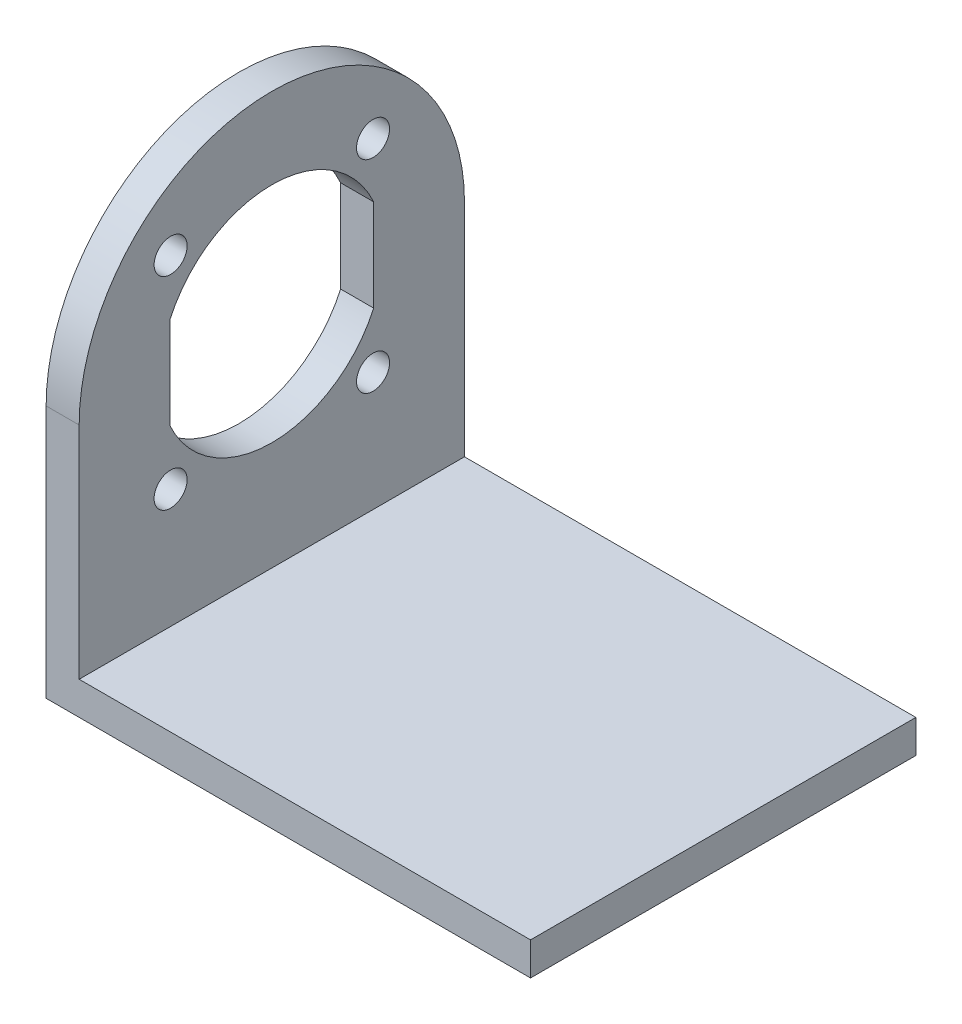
ISO-10303-21;
HEADER;
FILE_DESCRIPTION(('STEP AP214'),'2;1');
FILE_NAME('part.step','',(''),(''),'','','');
FILE_SCHEMA(('AUTOMOTIVE_DESIGN { 1 0 10303 214 1 1 1 1 }'));
ENDSEC;
DATA;
#1=APPLICATION_CONTEXT('core data for automotive mechanical design processes');
#2=APPLICATION_PROTOCOL_DEFINITION('international standard','automotive_design',2000,#1);
#3=PRODUCT_CONTEXT('',#1,'mechanical');
#4=PRODUCT('Part','Part','',(#3));
#5=PRODUCT_RELATED_PRODUCT_CATEGORY('part','',(#4));
#6=PRODUCT_DEFINITION_FORMATION('','',#4);
#7=PRODUCT_DEFINITION_CONTEXT('part definition',#1,'design');
#8=PRODUCT_DEFINITION('design','',#6,#7);
#9=PRODUCT_DEFINITION_SHAPE('','',#8);
#10=(LENGTH_UNIT() NAMED_UNIT(*) SI_UNIT(.MILLI.,.METRE.));
#11=(NAMED_UNIT(*) PLANE_ANGLE_UNIT() SI_UNIT($,.RADIAN.));
#12=(NAMED_UNIT(*) SI_UNIT($,.STERADIAN.) SOLID_ANGLE_UNIT());
#13=UNCERTAINTY_MEASURE_WITH_UNIT(LENGTH_MEASURE(1.E-05),#10,'distance_accuracy_value','');
#14=(GEOMETRIC_REPRESENTATION_CONTEXT(3) GLOBAL_UNCERTAINTY_ASSIGNED_CONTEXT((#13)) GLOBAL_UNIT_ASSIGNED_CONTEXT((#10,
#11,#12)) REPRESENTATION_CONTEXT('',''));
#15=CARTESIAN_POINT('',(0.,0.,0.));
#16=DIRECTION('',(0.,0.,1.));
#17=DIRECTION('',(1.,0.,0.));
#18=AXIS2_PLACEMENT_3D('',#15,#16,#17);
#19=CARTESIAN_POINT('',(3.,40.5,17.5));
#20=DIRECTION('',(-1.,0.,0.));
#21=DIRECTION('',(0.,-1.,0.));
#22=AXIS2_PLACEMENT_3D('',#19,#20,#21);
#23=PLANE('',#22);
#24=CARTESIAN_POINT('',(3.,32.1923881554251,-9.19238815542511));
#25=DIRECTION('',(-1.,0.,0.));
#26=DIRECTION('',(0.,-1.,0.));
#27=AXIS2_PLACEMENT_3D('',#24,#25,#26);
#28=CIRCLE('',#27,1.5);
#29=CARTESIAN_POINT('',(3.,30.6923881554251,-9.19238815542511));
#30=VERTEX_POINT('',#29);
#31=EDGE_CURVE('E275',#30,#30,#28,.F.);
#32=ORIENTED_EDGE('',*,*,#31,.F.);
#33=EDGE_LOOP('',(#32));
#34=FACE_BOUND('',#33,.T.);
#35=CARTESIAN_POINT('',(3.,13.8076118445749,9.19238815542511));
#36=DIRECTION('',(-1.,0.,0.));
#37=DIRECTION('',(0.,-1.,0.));
#38=AXIS2_PLACEMENT_3D('',#35,#36,#37);
#39=CIRCLE('',#38,1.5);
#40=CARTESIAN_POINT('',(3.,12.3076118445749,9.19238815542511));
#41=VERTEX_POINT('',#40);
#42=EDGE_CURVE('E328',#41,#41,#39,.F.);
#43=ORIENTED_EDGE('',*,*,#42,.F.);
#44=EDGE_LOOP('',(#43));
#45=FACE_BOUND('',#44,.T.);
#46=CARTESIAN_POINT('',(3.,23.,0.));
#47=DIRECTION('',(-1.,0.,0.));
#48=DIRECTION('',(0.,-1.,0.));
#49=AXIS2_PLACEMENT_3D('',#46,#47,#48);
#50=CIRCLE('',#49,10.15);
#51=CARTESIAN_POINT('',(3.,27.1785164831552,9.25));
#52=VERTEX_POINT('',#51);
#53=CARTESIAN_POINT('',(3.,27.1785164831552,-9.25));
#54=VERTEX_POINT('',#53);
#55=EDGE_CURVE('E322',#52,#54,#50,.T.);
#56=ORIENTED_EDGE('',*,*,#55,.T.);
#57=DIRECTION('',(0.,-1.,0.));
#58=VECTOR('',#57,1.);
#59=CARTESIAN_POINT('',(3.,40.5,-9.25));
#60=LINE('',#59,#58);
#61=CARTESIAN_POINT('',(3.,18.8214835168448,-9.25));
#62=VERTEX_POINT('',#61);
#63=EDGE_CURVE('E325',#54,#62,#60,.T.);
#64=ORIENTED_EDGE('',*,*,#63,.T.);
#65=CARTESIAN_POINT('',(3.,23.,0.));
#66=DIRECTION('',(-1.,0.,0.));
#67=DIRECTION('',(0.,-1.,0.));
#68=AXIS2_PLACEMENT_3D('',#65,#66,#67);
#69=CIRCLE('',#68,10.15);
#70=CARTESIAN_POINT('',(3.,18.8214835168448,9.25));
#71=VERTEX_POINT('',#70);
#72=EDGE_CURVE('E309',#62,#71,#69,.T.);
#73=ORIENTED_EDGE('',*,*,#72,.T.);
#74=DIRECTION('',(0.,-1.,0.));
#75=VECTOR('',#74,1.);
#76=CARTESIAN_POINT('',(3.,40.5,9.24999999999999));
#77=LINE('',#76,#75);
#78=EDGE_CURVE('E313',#52,#71,#77,.T.);
#79=ORIENTED_EDGE('',*,*,#78,.F.);
#80=EDGE_LOOP('',(#56,#64,#73,#79));
#81=FACE_BOUND('',#80,.T.);
#82=CARTESIAN_POINT('',(3.,13.8076118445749,-9.19238815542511));
#83=DIRECTION('',(-1.,0.,0.));
#84=DIRECTION('',(0.,-1.,0.));
#85=AXIS2_PLACEMENT_3D('',#82,#83,#84);
#86=CIRCLE('',#85,1.5);
#87=CARTESIAN_POINT('',(3.,12.3076118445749,-9.19238815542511));
#88=VERTEX_POINT('',#87);
#89=EDGE_CURVE('E331',#88,#88,#86,.T.);
#90=ORIENTED_EDGE('',*,*,#89,.T.);
#91=EDGE_LOOP('',(#90));
#92=FACE_BOUND('',#91,.T.);
#93=CARTESIAN_POINT('',(3.,32.1923881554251,9.19238815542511));
#94=DIRECTION('',(-1.,0.,0.));
#95=DIRECTION('',(0.,-1.,0.));
#96=AXIS2_PLACEMENT_3D('',#93,#94,#95);
#97=CIRCLE('',#96,1.5);
#98=CARTESIAN_POINT('',(3.,30.6923881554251,9.19238815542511));
#99=VERTEX_POINT('',#98);
#100=EDGE_CURVE('E334',#99,#99,#97,.T.);
#101=ORIENTED_EDGE('',*,*,#100,.T.);
#102=EDGE_LOOP('',(#101));
#103=FACE_BOUND('',#102,.T.);
#104=CARTESIAN_POINT('',(3.,23.,0.));
#105=DIRECTION('',(-1.,0.,0.));
#106=DIRECTION('',(0.,-1.,0.));
#107=AXIS2_PLACEMENT_3D('',#104,#105,#106);
#108=CIRCLE('',#107,17.5);
#109=CARTESIAN_POINT('',(3.,23.,17.5));
#110=VERTEX_POINT('',#109);
#111=CARTESIAN_POINT('',(3.,23.,-17.5));
#112=VERTEX_POINT('',#111);
#113=EDGE_CURVE('E308',#110,#112,#108,.T.);
#114=ORIENTED_EDGE('',*,*,#113,.F.);
#115=DIRECTION('',(0.,1.,0.));
#116=VECTOR('',#115,1.);
#117=CARTESIAN_POINT('',(3.,40.5,17.5));
#118=LINE('',#117,#116);
#119=CARTESIAN_POINT('',(3.,3.,17.5));
#120=VERTEX_POINT('',#119);
#121=EDGE_CURVE('E259',#120,#110,#118,.T.);
#122=ORIENTED_EDGE('',*,*,#121,.F.);
#123=DIRECTION('',(0.,0.,-1.));
#124=VECTOR('',#123,1.);
#125=CARTESIAN_POINT('',(3.,3.,17.5));
#126=LINE('',#125,#124);
#127=CARTESIAN_POINT('',(3.,3.,-17.5));
#128=VERTEX_POINT('',#127);
#129=EDGE_CURVE('E265',#120,#128,#126,.T.);
#130=ORIENTED_EDGE('',*,*,#129,.T.);
#131=DIRECTION('',(0.,1.,0.));
#132=VECTOR('',#131,1.);
#133=CARTESIAN_POINT('',(3.,40.5,-17.5));
#134=LINE('',#133,#132);
#135=EDGE_CURVE('E279',#128,#112,#134,.T.);
#136=ORIENTED_EDGE('',*,*,#135,.T.);
#137=EDGE_LOOP('',(#114,#122,#130,#136));
#138=FACE_BOUND('',#137,.T.);
#139=ADVANCED_FACE('F166',(#34,#45,#81,#92,#103,#138),#23,.F.);
#140=CARTESIAN_POINT('',(0.,0.,17.5));
#141=DIRECTION('',(1.,0.,0.));
#142=DIRECTION('',(0.,0.,-1.));
#143=AXIS2_PLACEMENT_3D('',#140,#141,#142);
#144=PLANE('',#143);
#145=CARTESIAN_POINT('',(0.,32.1923881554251,-9.19238815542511));
#146=DIRECTION('',(-1.,0.,0.));
#147=DIRECTION('',(0.,0.,1.));
#148=AXIS2_PLACEMENT_3D('',#145,#146,#147);
#149=CIRCLE('',#148,1.5);
#150=CARTESIAN_POINT('',(0.,32.1923881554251,-7.69238815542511));
#151=VERTEX_POINT('',#150);
#152=EDGE_CURVE('E564',#151,#151,#149,.F.);
#153=ORIENTED_EDGE('',*,*,#152,.T.);
#154=EDGE_LOOP('',(#153));
#155=FACE_BOUND('',#154,.T.);
#156=CARTESIAN_POINT('',(0.,13.8076118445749,9.19238815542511));
#157=DIRECTION('',(-1.,0.,0.));
#158=DIRECTION('',(0.,0.,1.));
#159=AXIS2_PLACEMENT_3D('',#156,#157,#158);
#160=CIRCLE('',#159,1.5);
#161=CARTESIAN_POINT('',(0.,13.8076118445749,10.6923881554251));
#162=VERTEX_POINT('',#161);
#163=EDGE_CURVE('E251',#162,#162,#160,.F.);
#164=ORIENTED_EDGE('',*,*,#163,.T.);
#165=EDGE_LOOP('',(#164));
#166=FACE_BOUND('',#165,.T.);
#167=CARTESIAN_POINT('',(0.,23.,0.));
#168=DIRECTION('',(-1.,0.,0.));
#169=DIRECTION('',(0.,0.,1.));
#170=AXIS2_PLACEMENT_3D('',#167,#168,#169);
#171=CIRCLE('',#170,10.15);
#172=CARTESIAN_POINT('',(0.,18.8214835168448,-9.25));
#173=VERTEX_POINT('',#172);
#174=CARTESIAN_POINT('',(0.,18.8214835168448,9.25));
#175=VERTEX_POINT('',#174);
#176=EDGE_CURVE('E571',#173,#175,#171,.T.);
#177=ORIENTED_EDGE('',*,*,#176,.F.);
#178=DIRECTION('',(0.,-1.,0.));
#179=VECTOR('',#178,1.);
#180=CARTESIAN_POINT('',(0.,0.,-9.25));
#181=LINE('',#180,#179);
#182=CARTESIAN_POINT('',(0.,27.1785164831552,-9.25));
#183=VERTEX_POINT('',#182);
#184=EDGE_CURVE('E189',#183,#173,#181,.T.);
#185=ORIENTED_EDGE('',*,*,#184,.F.);
#186=CARTESIAN_POINT('',(0.,23.,0.));
#187=DIRECTION('',(-1.,0.,0.));
#188=DIRECTION('',(0.,0.,1.));
#189=AXIS2_PLACEMENT_3D('',#186,#187,#188);
#190=CIRCLE('',#189,10.15);
#191=CARTESIAN_POINT('',(0.,27.1785164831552,9.25));
#192=VERTEX_POINT('',#191);
#193=EDGE_CURVE('E587',#192,#183,#190,.T.);
#194=ORIENTED_EDGE('',*,*,#193,.F.);
#195=DIRECTION('',(0.,-1.,0.));
#196=VECTOR('',#195,1.);
#197=CARTESIAN_POINT('',(0.,0.,9.25));
#198=LINE('',#197,#196);
#199=EDGE_CURVE('E585',#192,#175,#198,.T.);
#200=ORIENTED_EDGE('',*,*,#199,.T.);
#201=EDGE_LOOP('',(#177,#185,#194,#200));
#202=FACE_BOUND('',#201,.T.);
#203=CARTESIAN_POINT('',(0.,13.8076118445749,-9.19238815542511));
#204=DIRECTION('',(-1.,0.,0.));
#205=DIRECTION('',(0.,0.,1.));
#206=AXIS2_PLACEMENT_3D('',#203,#204,#205);
#207=CIRCLE('',#206,1.5);
#208=CARTESIAN_POINT('',(0.,13.8076118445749,-7.69238815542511));
#209=VERTEX_POINT('',#208);
#210=EDGE_CURVE('E575',#209,#209,#207,.T.);
#211=ORIENTED_EDGE('',*,*,#210,.F.);
#212=EDGE_LOOP('',(#211));
#213=FACE_BOUND('',#212,.T.);
#214=CARTESIAN_POINT('',(0.,32.1923881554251,9.19238815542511));
#215=DIRECTION('',(-1.,0.,0.));
#216=DIRECTION('',(0.,0.,1.));
#217=AXIS2_PLACEMENT_3D('',#214,#215,#216);
#218=CIRCLE('',#217,1.5);
#219=CARTESIAN_POINT('',(0.,32.1923881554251,10.6923881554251));
#220=VERTEX_POINT('',#219);
#221=EDGE_CURVE('E577',#220,#220,#218,.T.);
#222=ORIENTED_EDGE('',*,*,#221,.F.);
#223=EDGE_LOOP('',(#222));
#224=FACE_BOUND('',#223,.T.);
#225=DIRECTION('',(0.,-1.,0.));
#226=VECTOR('',#225,1.);
#227=CARTESIAN_POINT('',(0.,0.,17.5));
#228=LINE('',#227,#226);
#229=CARTESIAN_POINT('',(0.,23.,17.5));
#230=VERTEX_POINT('',#229);
#231=CARTESIAN_POINT('',(0.,0.,17.5));
#232=VERTEX_POINT('',#231);
#233=EDGE_CURVE('E256',#230,#232,#228,.T.);
#234=ORIENTED_EDGE('',*,*,#233,.F.);
#235=CARTESIAN_POINT('',(0.,23.,0.));
#236=DIRECTION('',(-1.,0.,0.));
#237=DIRECTION('',(0.,0.,1.));
#238=AXIS2_PLACEMENT_3D('',#235,#236,#237);
#239=CIRCLE('',#238,17.5);
#240=CARTESIAN_POINT('',(0.,23.,-17.5));
#241=VERTEX_POINT('',#240);
#242=EDGE_CURVE('E244',#230,#241,#239,.T.);
#243=ORIENTED_EDGE('',*,*,#242,.T.);
#244=DIRECTION('',(0.,-1.,0.));
#245=VECTOR('',#244,1.);
#246=CARTESIAN_POINT('',(0.,0.,-17.5));
#247=LINE('',#246,#245);
#248=CARTESIAN_POINT('',(0.,0.,-17.5));
#249=VERTEX_POINT('',#248);
#250=EDGE_CURVE('E282',#241,#249,#247,.T.);
#251=ORIENTED_EDGE('',*,*,#250,.T.);
#252=DIRECTION('',(0.,0.,-1.));
#253=VECTOR('',#252,1.);
#254=CARTESIAN_POINT('',(0.,0.,17.5));
#255=LINE('',#254,#253);
#256=EDGE_CURVE('E262',#232,#249,#255,.T.);
#257=ORIENTED_EDGE('',*,*,#256,.F.);
#258=EDGE_LOOP('',(#234,#243,#251,#257));
#259=FACE_BOUND('',#258,.T.);
#260=ADVANCED_FACE('F260',(#155,#166,#202,#213,#224,#259),#144,.F.);
#261=CARTESIAN_POINT('',(44.,0.,17.5));
#262=DIRECTION('',(0.,1.,0.));
#263=DIRECTION('',(-1.,0.,0.));
#264=AXIS2_PLACEMENT_3D('',#261,#262,#263);
#265=PLANE('',#264);
#266=DIRECTION('',(1.,0.,0.));
#267=VECTOR('',#266,1.);
#268=CARTESIAN_POINT('',(44.,0.,-17.5));
#269=LINE('',#268,#267);
#270=CARTESIAN_POINT('',(44.,0.,-17.5));
#271=VERTEX_POINT('',#270);
#272=EDGE_CURVE('E271',#249,#271,#269,.T.);
#273=ORIENTED_EDGE('',*,*,#272,.T.);
#274=DIRECTION('',(0.,0.,-1.));
#275=VECTOR('',#274,1.);
#276=CARTESIAN_POINT('',(44.,0.,17.5));
#277=LINE('',#276,#275);
#278=CARTESIAN_POINT('',(44.,0.,17.5));
#279=VERTEX_POINT('',#278);
#280=EDGE_CURVE('E290',#279,#271,#277,.T.);
#281=ORIENTED_EDGE('',*,*,#280,.F.);
#282=DIRECTION('',(1.,0.,0.));
#283=VECTOR('',#282,1.);
#284=CARTESIAN_POINT('',(44.,0.,17.5));
#285=LINE('',#284,#283);
#286=EDGE_CURVE('E283',#232,#279,#285,.T.);
#287=ORIENTED_EDGE('',*,*,#286,.F.);
#288=ORIENTED_EDGE('',*,*,#256,.T.);
#289=EDGE_LOOP('',(#273,#281,#287,#288));
#290=FACE_BOUND('',#289,.T.);
#291=ADVANCED_FACE('F168',(#290),#265,.F.);
#292=CARTESIAN_POINT('',(44.,3.,17.5));
#293=DIRECTION('',(-1.,0.,0.));
#294=DIRECTION('',(0.,0.,1.));
#295=AXIS2_PLACEMENT_3D('',#292,#293,#294);
#296=PLANE('',#295);
#297=DIRECTION('',(0.,1.,0.));
#298=VECTOR('',#297,1.);
#299=CARTESIAN_POINT('',(44.,3.,-17.5));
#300=LINE('',#299,#298);
#301=CARTESIAN_POINT('',(44.,3.,-17.5));
#302=VERTEX_POINT('',#301);
#303=EDGE_CURVE('E274',#271,#302,#300,.T.);
#304=ORIENTED_EDGE('',*,*,#303,.T.);
#305=DIRECTION('',(0.,0.,-1.));
#306=VECTOR('',#305,1.);
#307=CARTESIAN_POINT('',(44.,3.,17.5));
#308=LINE('',#307,#306);
#309=CARTESIAN_POINT('',(44.,3.,17.5));
#310=VERTEX_POINT('',#309);
#311=EDGE_CURVE('E287',#310,#302,#308,.T.);
#312=ORIENTED_EDGE('',*,*,#311,.F.);
#313=DIRECTION('',(0.,1.,0.));
#314=VECTOR('',#313,1.);
#315=CARTESIAN_POINT('',(44.,3.,17.5));
#316=LINE('',#315,#314);
#317=EDGE_CURVE('E296',#279,#310,#316,.T.);
#318=ORIENTED_EDGE('',*,*,#317,.F.);
#319=ORIENTED_EDGE('',*,*,#280,.T.);
#320=EDGE_LOOP('',(#304,#312,#318,#319));
#321=FACE_BOUND('',#320,.T.);
#322=ADVANCED_FACE('F294',(#321),#296,.F.);
#323=CARTESIAN_POINT('',(3.,3.,17.5));
#324=DIRECTION('',(0.,-1.,0.));
#325=DIRECTION('',(1.,0.,0.));
#326=AXIS2_PLACEMENT_3D('',#323,#324,#325);
#327=PLANE('',#326);
#328=DIRECTION('',(-1.,0.,0.));
#329=VECTOR('',#328,1.);
#330=CARTESIAN_POINT('',(3.,3.,-17.5));
#331=LINE('',#330,#329);
#332=EDGE_CURVE('E277',#302,#128,#331,.T.);
#333=ORIENTED_EDGE('',*,*,#332,.T.);
#334=ORIENTED_EDGE('',*,*,#129,.F.);
#335=DIRECTION('',(-1.,0.,0.));
#336=VECTOR('',#335,1.);
#337=CARTESIAN_POINT('',(3.,3.,17.5));
#338=LINE('',#337,#336);
#339=EDGE_CURVE('E267',#310,#120,#338,.T.);
#340=ORIENTED_EDGE('',*,*,#339,.F.);
#341=ORIENTED_EDGE('',*,*,#311,.T.);
#342=EDGE_LOOP('',(#333,#334,#340,#341));
#343=FACE_BOUND('',#342,.T.);
#344=ADVANCED_FACE('F305',(#343),#327,.F.);
#345=CARTESIAN_POINT('',(0.,0.,17.5));
#346=DIRECTION('',(0.,0.,-1.));
#347=DIRECTION('',(-1.,0.,0.));
#348=AXIS2_PLACEMENT_3D('',#345,#346,#347);
#349=PLANE('',#348);
#350=ORIENTED_EDGE('',*,*,#121,.T.);
#351=DIRECTION('',(-1.,0.,0.));
#352=VECTOR('',#351,1.);
#353=CARTESIAN_POINT('',(35.,23.,17.5));
#354=LINE('',#353,#352);
#355=EDGE_CURVE('E12',#110,#230,#354,.T.);
#356=ORIENTED_EDGE('',*,*,#355,.T.);
#357=ORIENTED_EDGE('',*,*,#233,.T.);
#358=ORIENTED_EDGE('',*,*,#286,.T.);
#359=ORIENTED_EDGE('',*,*,#317,.T.);
#360=ORIENTED_EDGE('',*,*,#339,.T.);
#361=EDGE_LOOP('',(#350,#356,#357,#358,#359,#360));
#362=FACE_BOUND('',#361,.T.);
#363=ADVANCED_FACE('F254',(#362),#349,.F.);
#364=CARTESIAN_POINT('',(0.,0.,-17.5));
#365=DIRECTION('',(0.,0.,-1.));
#366=DIRECTION('',(-1.,0.,0.));
#367=AXIS2_PLACEMENT_3D('',#364,#365,#366);
#368=PLANE('',#367);
#369=DIRECTION('',(-1.,0.,0.));
#370=VECTOR('',#369,1.);
#371=CARTESIAN_POINT('',(35.,23.,-17.5));
#372=LINE('',#371,#370);
#373=EDGE_CURVE('E174',#112,#241,#372,.T.);
#374=ORIENTED_EDGE('',*,*,#373,.F.);
#375=ORIENTED_EDGE('',*,*,#135,.F.);
#376=ORIENTED_EDGE('',*,*,#332,.F.);
#377=ORIENTED_EDGE('',*,*,#303,.F.);
#378=ORIENTED_EDGE('',*,*,#272,.F.);
#379=ORIENTED_EDGE('',*,*,#250,.F.);
#380=EDGE_LOOP('',(#374,#375,#376,#377,#378,#379));
#381=FACE_BOUND('',#380,.T.);
#382=ADVANCED_FACE('F300',(#381),#368,.T.);
#383=CARTESIAN_POINT('',(35.,23.,0.));
#384=DIRECTION('',(-1.,0.,0.));
#385=DIRECTION('',(0.,0.,1.));
#386=AXIS2_PLACEMENT_3D('',#383,#384,#385);
#387=CYLINDRICAL_SURFACE('',#386,17.5);
#388=ORIENTED_EDGE('',*,*,#113,.T.);
#389=ORIENTED_EDGE('',*,*,#373,.T.);
#390=ORIENTED_EDGE('',*,*,#242,.F.);
#391=ORIENTED_EDGE('',*,*,#355,.F.);
#392=EDGE_LOOP('',(#388,#389,#390,#391));
#393=FACE_BOUND('',#392,.T.);
#394=ADVANCED_FACE('F245',(#393),#387,.T.);
#395=CARTESIAN_POINT('',(35.,0.,-9.25));
#396=DIRECTION('',(0.,0.,-1.));
#397=DIRECTION('',(0.,1.,0.));
#398=AXIS2_PLACEMENT_3D('',#395,#396,#397);
#399=PLANE('',#398);
#400=DIRECTION('',(-1.,0.,0.));
#401=VECTOR('',#400,1.);
#402=CARTESIAN_POINT('',(35.,27.1785164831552,-9.25));
#403=LINE('',#402,#401);
#404=EDGE_CURVE('E310',#54,#183,#403,.T.);
#405=ORIENTED_EDGE('',*,*,#404,.T.);
#406=ORIENTED_EDGE('',*,*,#184,.T.);
#407=DIRECTION('',(-1.,0.,0.));
#408=VECTOR('',#407,1.);
#409=CARTESIAN_POINT('',(35.,18.8214835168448,-9.25));
#410=LINE('',#409,#408);
#411=EDGE_CURVE('E318',#62,#173,#410,.T.);
#412=ORIENTED_EDGE('',*,*,#411,.F.);
#413=ORIENTED_EDGE('',*,*,#63,.F.);
#414=EDGE_LOOP('',(#405,#406,#412,#413));
#415=FACE_BOUND('',#414,.T.);
#416=ADVANCED_FACE('F380',(#415),#399,.F.);
#417=CARTESIAN_POINT('',(35.,23.,0.));
#418=DIRECTION('',(-1.,0.,0.));
#419=DIRECTION('',(0.,0.,1.));
#420=AXIS2_PLACEMENT_3D('',#417,#418,#419);
#421=CYLINDRICAL_SURFACE('',#420,10.15);
#422=DIRECTION('',(-1.,0.,0.));
#423=VECTOR('',#422,1.);
#424=CARTESIAN_POINT('',(35.,27.1785164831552,9.25));
#425=LINE('',#424,#423);
#426=EDGE_CURVE('E315',#52,#192,#425,.T.);
#427=ORIENTED_EDGE('',*,*,#426,.T.);
#428=ORIENTED_EDGE('',*,*,#193,.T.);
#429=ORIENTED_EDGE('',*,*,#404,.F.);
#430=ORIENTED_EDGE('',*,*,#55,.F.);
#431=EDGE_LOOP('',(#427,#428,#429,#430));
#432=FACE_BOUND('',#431,.T.);
#433=ADVANCED_FACE('F376',(#432),#421,.F.);
#434=CARTESIAN_POINT('',(35.,0.,9.25));
#435=DIRECTION('',(0.,0.,-1.));
#436=DIRECTION('',(0.,1.,0.));
#437=AXIS2_PLACEMENT_3D('',#434,#435,#436);
#438=PLANE('',#437);
#439=ORIENTED_EDGE('',*,*,#78,.T.);
#440=DIRECTION('',(-1.,0.,0.));
#441=VECTOR('',#440,1.);
#442=CARTESIAN_POINT('',(35.,18.8214835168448,9.25));
#443=LINE('',#442,#441);
#444=EDGE_CURVE('E181',#71,#175,#443,.T.);
#445=ORIENTED_EDGE('',*,*,#444,.T.);
#446=ORIENTED_EDGE('',*,*,#199,.F.);
#447=ORIENTED_EDGE('',*,*,#426,.F.);
#448=EDGE_LOOP('',(#439,#445,#446,#447));
#449=FACE_BOUND('',#448,.T.);
#450=ADVANCED_FACE('F379',(#449),#438,.T.);
#451=CARTESIAN_POINT('',(35.,23.,0.));
#452=DIRECTION('',(-1.,0.,0.));
#453=DIRECTION('',(0.,0.,1.));
#454=AXIS2_PLACEMENT_3D('',#451,#452,#453);
#455=CYLINDRICAL_SURFACE('',#454,10.15);
#456=ORIENTED_EDGE('',*,*,#411,.T.);
#457=ORIENTED_EDGE('',*,*,#176,.T.);
#458=ORIENTED_EDGE('',*,*,#444,.F.);
#459=ORIENTED_EDGE('',*,*,#72,.F.);
#460=EDGE_LOOP('',(#456,#457,#458,#459));
#461=FACE_BOUND('',#460,.T.);
#462=ADVANCED_FACE('F374',(#461),#455,.F.);
#463=CARTESIAN_POINT('',(35.,13.8076118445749,9.19238815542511));
#464=DIRECTION('',(-1.,0.,0.));
#465=DIRECTION('',(0.,0.,1.));
#466=AXIS2_PLACEMENT_3D('',#463,#464,#465);
#467=CYLINDRICAL_SURFACE('',#466,1.5);
#468=ORIENTED_EDGE('',*,*,#163,.F.);
#469=EDGE_LOOP('',(#468));
#470=FACE_BOUND('',#469,.T.);
#471=ORIENTED_EDGE('',*,*,#42,.T.);
#472=EDGE_LOOP('',(#471));
#473=FACE_BOUND('',#472,.T.);
#474=ADVANCED_FACE('F366',(#470,#473),#467,.F.);
#475=CARTESIAN_POINT('',(35.,13.8076118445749,-9.19238815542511));
#476=DIRECTION('',(-1.,0.,0.));
#477=DIRECTION('',(0.,0.,1.));
#478=AXIS2_PLACEMENT_3D('',#475,#476,#477);
#479=CYLINDRICAL_SURFACE('',#478,1.5);
#480=ORIENTED_EDGE('',*,*,#210,.T.);
#481=EDGE_LOOP('',(#480));
#482=FACE_BOUND('',#481,.T.);
#483=ORIENTED_EDGE('',*,*,#89,.F.);
#484=EDGE_LOOP('',(#483));
#485=FACE_BOUND('',#484,.T.);
#486=ADVANCED_FACE('F357',(#482,#485),#479,.F.);
#487=CARTESIAN_POINT('',(35.,32.1923881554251,9.19238815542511));
#488=DIRECTION('',(-1.,0.,0.));
#489=DIRECTION('',(0.,0.,1.));
#490=AXIS2_PLACEMENT_3D('',#487,#488,#489);
#491=CYLINDRICAL_SURFACE('',#490,1.5);
#492=ORIENTED_EDGE('',*,*,#221,.T.);
#493=EDGE_LOOP('',(#492));
#494=FACE_BOUND('',#493,.T.);
#495=ORIENTED_EDGE('',*,*,#100,.F.);
#496=EDGE_LOOP('',(#495));
#497=FACE_BOUND('',#496,.T.);
#498=ADVANCED_FACE('F355',(#494,#497),#491,.F.);
#499=CARTESIAN_POINT('',(35.,32.1923881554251,-9.19238815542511));
#500=DIRECTION('',(-1.,0.,0.));
#501=DIRECTION('',(0.,0.,1.));
#502=AXIS2_PLACEMENT_3D('',#499,#500,#501);
#503=CYLINDRICAL_SURFACE('',#502,1.5);
#504=ORIENTED_EDGE('',*,*,#152,.F.);
#505=EDGE_LOOP('',(#504));
#506=FACE_BOUND('',#505,.T.);
#507=ORIENTED_EDGE('',*,*,#31,.T.);
#508=EDGE_LOOP('',(#507));
#509=FACE_BOUND('',#508,.T.);
#510=ADVANCED_FACE('F342',(#506,#509),#503,.F.);
#511=CLOSED_SHELL('',(#139,#260,#291,#322,#344,#363,#382,#394,#416,#433,#450,#462,#474,#486,
#498,#510));
#512=MANIFOLD_SOLID_BREP('B2',#511);
#513=ADVANCED_BREP_SHAPE_REPRESENTATION('',(#18,#512),#14);
#514=SHAPE_DEFINITION_REPRESENTATION(#9,#513);
ENDSEC;
END-ISO-10303-21;
